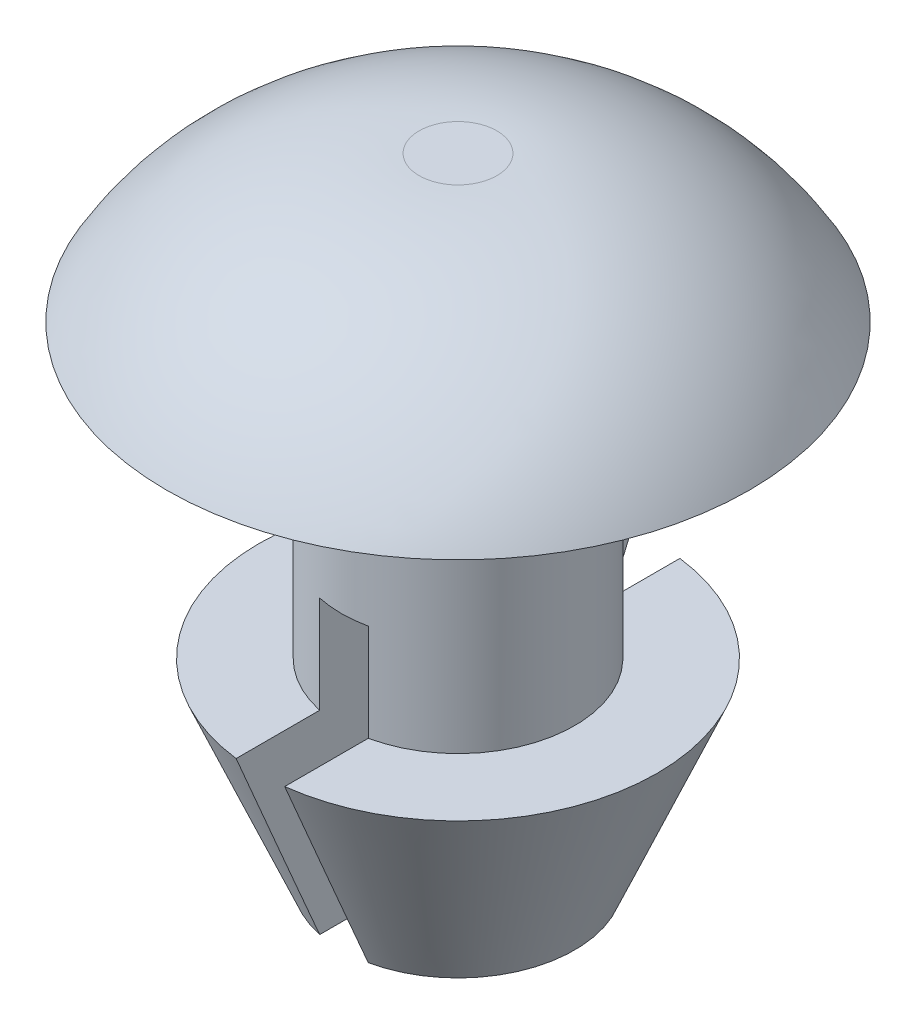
from build123d import *

# Parameters (mm, degrees)
SKETCH1_R           = 1.524
BOSS_EXTRUDE1_DEPTH = 6.35
SKETCH2_R           = 1.524
BOSS_EXTRUDE2_DEPTH = 2.54
BOSS_EXTRUDE2_DRAFT = 23
SKETCH3_W           = 0.635
SKETCH3_H           = 16.365642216
CUT_EXTRUDE1_DEPTH  = 3.81


with BuildPart() as part:
    # Sketch1 → Boss-Extrude1 (new body)
    with BuildSketch(Plane(origin=(0, 0, 0), x_dir=(1, 0, 0), z_dir=(0, 1, 0))):
        with Locations(Location((0, 0, 0), (0, 0, 270))):
            Circle(SKETCH1_R)
    extrude(amount=BOSS_EXTRUDE1_DEPTH)


with BuildPart() as boss_extrude2_tool:
    # Sketch2 → Boss-Extrude2 (with draft: the straight prism first)
    with BuildSketch(Plane.XZ):
        with Locations(Location((0, 0, 0), (0, 0, 270))):
            Circle(SKETCH2_R)
    extrude(amount=-BOSS_EXTRUDE2_DEPTH)
    # Boss-Extrude2: the draft: its side faces are tilted about the plane it starts from
    boss_extrude2_sides = [boss_extrude2_tool.faces().sort_by_distance(p)[0] for p in [
        (0, 1.27, 1.524),
    ]]
    draft(boss_extrude2_sides, Plane.XZ, BOSS_EXTRUDE2_DRAFT)


with BuildPart() as part_1:
    add(part.part)

    # Boss-Extrude2: add boss_extrude2_tool
    add(boss_extrude2_tool.part)

    # Sketch3 → Cut-Extrude1 (cut)
    with BuildSketch(Plane.XZ):
        Rectangle(SKETCH3_W, SKETCH3_H)
    extrude(amount=-CUT_EXTRUDE1_DEPTH, mode=Mode.SUBTRACT)

    # Sketch4 → Revolve1 (revolve)
    with BuildSketch(Plane.XY, mode=Mode.PRIVATE) as revolve1_sk:
        with BuildLine():
            Line((0, 6.35), (3.81, 6.35))
            ThreePointArc((3.81, 6.35), (2.415117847, 7.74757119), (0.508, 8.259238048))
            Line((0.508, 8.259238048), (0, 8.259238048))
            Line((0, 8.259238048), (0, 6.35))
        make_face()
    revolve(revolve1_sk.sketch.rotate(Axis((0, 0, 0), (0, 1, 0)), 77.975300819), axis=Axis((0, 0, 0), (0, 1, 0)))


solid = part_1.part
